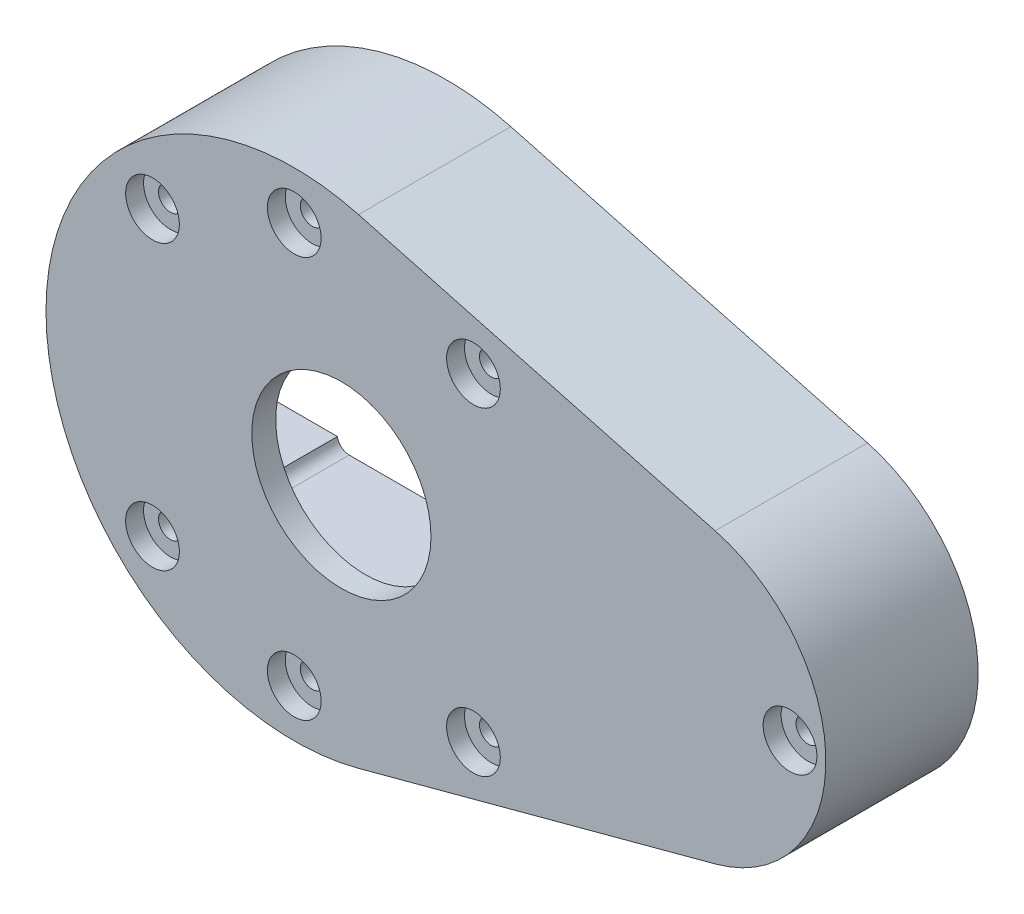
ISO-10303-21;
HEADER;
FILE_DESCRIPTION(('STEP AP214'),'2;1');
FILE_NAME('part.step','',(''),(''),'','','');
FILE_SCHEMA(('AUTOMOTIVE_DESIGN { 1 0 10303 214 1 1 1 1 }'));
ENDSEC;
DATA;
#1=APPLICATION_CONTEXT('core data for automotive mechanical design processes');
#2=APPLICATION_PROTOCOL_DEFINITION('international standard','automotive_design',2000,#1);
#3=PRODUCT_CONTEXT('',#1,'mechanical');
#4=PRODUCT('Part','Part','',(#3));
#5=PRODUCT_RELATED_PRODUCT_CATEGORY('part','',(#4));
#6=PRODUCT_DEFINITION_FORMATION('','',#4);
#7=PRODUCT_DEFINITION_CONTEXT('part definition',#1,'design');
#8=PRODUCT_DEFINITION('design','',#6,#7);
#9=PRODUCT_DEFINITION_SHAPE('','',#8);
#10=(LENGTH_UNIT() NAMED_UNIT(*) SI_UNIT(.MILLI.,.METRE.));
#11=(NAMED_UNIT(*) PLANE_ANGLE_UNIT() SI_UNIT($,.RADIAN.));
#12=(NAMED_UNIT(*) SI_UNIT($,.STERADIAN.) SOLID_ANGLE_UNIT());
#13=UNCERTAINTY_MEASURE_WITH_UNIT(LENGTH_MEASURE(1.E-05),#10,'distance_accuracy_value','');
#14=(GEOMETRIC_REPRESENTATION_CONTEXT(3) GLOBAL_UNCERTAINTY_ASSIGNED_CONTEXT((#13)) GLOBAL_UNIT_ASSIGNED_CONTEXT((#10,
#11,#12)) REPRESENTATION_CONTEXT('',''));
#15=CARTESIAN_POINT('',(0.,0.,0.));
#16=DIRECTION('',(0.,0.,1.));
#17=DIRECTION('',(1.,0.,0.));
#18=AXIS2_PLACEMENT_3D('',#15,#16,#17);
#19=CARTESIAN_POINT('',(29.9,0.,12.75));
#20=DIRECTION('',(0.,0.,-1.));
#21=DIRECTION('',(-1.,0.,0.));
#22=AXIS2_PLACEMENT_3D('',#19,#20,#21);
#23=CYLINDRICAL_SURFACE('',#22,1.);
#24=CARTESIAN_POINT('',(29.9,0.,0.));
#25=DIRECTION('',(0.,0.,1.));
#26=DIRECTION('',(1.,0.,0.));
#27=AXIS2_PLACEMENT_3D('',#24,#25,#26);
#28=CIRCLE('',#27,1.);
#29=CARTESIAN_POINT('',(30.9,0.,0.));
#30=VERTEX_POINT('',#29);
#31=EDGE_CURVE('E378',#30,#30,#28,.T.);
#32=ORIENTED_EDGE('',*,*,#31,.F.);
#33=EDGE_LOOP('',(#32));
#34=FACE_BOUND('',#33,.T.);
#35=CARTESIAN_POINT('',(29.9,0.,11.25));
#36=DIRECTION('',(0.,0.,1.));
#37=DIRECTION('',(1.,0.,0.));
#38=AXIS2_PLACEMENT_3D('',#35,#36,#37);
#39=CIRCLE('',#38,1.);
#40=CARTESIAN_POINT('',(30.9,0.,11.25));
#41=VERTEX_POINT('',#40);
#42=EDGE_CURVE('E47',#41,#41,#39,.T.);
#43=ORIENTED_EDGE('',*,*,#42,.T.);
#44=EDGE_LOOP('',(#43));
#45=FACE_BOUND('',#44,.T.);
#46=ADVANCED_FACE('F43',(#34,#45),#23,.F.);
#47=CARTESIAN_POINT('',(3.40000000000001,13.3549838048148,12.75));
#48=DIRECTION('',(0.,0.,-1.));
#49=DIRECTION('',(-1.,0.,0.));
#50=AXIS2_PLACEMENT_3D('',#47,#48,#49);
#51=CYLINDRICAL_SURFACE('',#50,1.);
#52=CARTESIAN_POINT('',(3.40000000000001,13.3549838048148,0.));
#53=DIRECTION('',(0.,0.,1.));
#54=DIRECTION('',(1.,0.,0.));
#55=AXIS2_PLACEMENT_3D('',#52,#53,#54);
#56=CIRCLE('',#55,1.);
#57=CARTESIAN_POINT('',(4.40000000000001,13.3549838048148,0.));
#58=VERTEX_POINT('',#57);
#59=EDGE_CURVE('E375',#58,#58,#56,.T.);
#60=ORIENTED_EDGE('',*,*,#59,.F.);
#61=EDGE_LOOP('',(#60));
#62=FACE_BOUND('',#61,.T.);
#63=CARTESIAN_POINT('',(3.40000000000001,13.3549838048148,11.25));
#64=DIRECTION('',(0.,0.,1.));
#65=DIRECTION('',(1.,0.,0.));
#66=AXIS2_PLACEMENT_3D('',#63,#64,#65);
#67=CIRCLE('',#66,1.);
#68=CARTESIAN_POINT('',(4.40000000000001,13.3549838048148,11.25));
#69=VERTEX_POINT('',#68);
#70=EDGE_CURVE('E261',#69,#69,#67,.T.);
#71=ORIENTED_EDGE('',*,*,#70,.T.);
#72=EDGE_LOOP('',(#71));
#73=FACE_BOUND('',#72,.T.);
#74=ADVANCED_FACE('F418',(#62,#73),#51,.F.);
#75=CARTESIAN_POINT('',(-11.6000000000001,16.7822094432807,12.75));
#76=DIRECTION('',(0.,0.,-1.));
#77=DIRECTION('',(-1.,0.,0.));
#78=AXIS2_PLACEMENT_3D('',#75,#76,#77);
#79=CYLINDRICAL_SURFACE('',#78,1.);
#80=CARTESIAN_POINT('',(-11.6000000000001,16.7822094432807,0.));
#81=DIRECTION('',(0.,0.,1.));
#82=DIRECTION('',(1.,0.,0.));
#83=AXIS2_PLACEMENT_3D('',#80,#81,#82);
#84=CIRCLE('',#83,1.);
#85=CARTESIAN_POINT('',(-10.6000000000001,16.7822094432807,0.));
#86=VERTEX_POINT('',#85);
#87=EDGE_CURVE('E372',#86,#86,#84,.T.);
#88=ORIENTED_EDGE('',*,*,#87,.F.);
#89=EDGE_LOOP('',(#88));
#90=FACE_BOUND('',#89,.T.);
#91=CARTESIAN_POINT('',(-11.6000000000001,16.7822094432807,11.25));
#92=DIRECTION('',(0.,0.,1.));
#93=DIRECTION('',(1.,0.,0.));
#94=AXIS2_PLACEMENT_3D('',#91,#92,#93);
#95=CIRCLE('',#94,1.);
#96=CARTESIAN_POINT('',(-10.6000000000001,16.7822094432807,11.25));
#97=VERTEX_POINT('',#96);
#98=EDGE_CURVE('E259',#97,#97,#95,.T.);
#99=ORIENTED_EDGE('',*,*,#98,.T.);
#100=EDGE_LOOP('',(#99));
#101=FACE_BOUND('',#100,.T.);
#102=ADVANCED_FACE('F423',(#90,#101),#79,.F.);
#103=CARTESIAN_POINT('',(3.40000000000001,-13.3549838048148,12.75));
#104=DIRECTION('',(0.,0.,-1.));
#105=DIRECTION('',(-1.,0.,0.));
#106=AXIS2_PLACEMENT_3D('',#103,#104,#105);
#107=CYLINDRICAL_SURFACE('',#106,1.);
#108=CARTESIAN_POINT('',(3.40000000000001,-13.3549838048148,0.));
#109=DIRECTION('',(0.,0.,1.));
#110=DIRECTION('',(1.,0.,0.));
#111=AXIS2_PLACEMENT_3D('',#108,#109,#110);
#112=CIRCLE('',#111,1.);
#113=CARTESIAN_POINT('',(4.40000000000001,-13.3549838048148,0.));
#114=VERTEX_POINT('',#113);
#115=EDGE_CURVE('E369',#114,#114,#112,.T.);
#116=ORIENTED_EDGE('',*,*,#115,.F.);
#117=EDGE_LOOP('',(#116));
#118=FACE_BOUND('',#117,.T.);
#119=CARTESIAN_POINT('',(3.40000000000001,-13.3549838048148,11.25));
#120=DIRECTION('',(0.,0.,1.));
#121=DIRECTION('',(1.,0.,0.));
#122=AXIS2_PLACEMENT_3D('',#119,#120,#121);
#123=CIRCLE('',#122,1.);
#124=CARTESIAN_POINT('',(4.40000000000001,-13.3549838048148,11.25));
#125=VERTEX_POINT('',#124);
#126=EDGE_CURVE('E256',#125,#125,#123,.T.);
#127=ORIENTED_EDGE('',*,*,#126,.T.);
#128=EDGE_LOOP('',(#127));
#129=FACE_BOUND('',#128,.T.);
#130=ADVANCED_FACE('F430',(#118,#129),#107,.F.);
#131=CARTESIAN_POINT('',(-11.6,-16.7822094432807,12.75));
#132=DIRECTION('',(0.,0.,-1.));
#133=DIRECTION('',(-1.,0.,0.));
#134=AXIS2_PLACEMENT_3D('',#131,#132,#133);
#135=CYLINDRICAL_SURFACE('',#134,1.);
#136=CARTESIAN_POINT('',(-11.6,-16.7822094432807,0.));
#137=DIRECTION('',(0.,0.,1.));
#138=DIRECTION('',(1.,0.,0.));
#139=AXIS2_PLACEMENT_3D('',#136,#137,#138);
#140=CIRCLE('',#139,1.);
#141=CARTESIAN_POINT('',(-10.6,-16.7822094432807,0.));
#142=VERTEX_POINT('',#141);
#143=EDGE_CURVE('E366',#142,#142,#140,.T.);
#144=ORIENTED_EDGE('',*,*,#143,.F.);
#145=EDGE_LOOP('',(#144));
#146=FACE_BOUND('',#145,.T.);
#147=CARTESIAN_POINT('',(-11.6,-16.7822094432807,11.25));
#148=DIRECTION('',(0.,0.,1.));
#149=DIRECTION('',(1.,0.,0.));
#150=AXIS2_PLACEMENT_3D('',#147,#148,#149);
#151=CIRCLE('',#150,1.);
#152=CARTESIAN_POINT('',(-10.6,-16.7822094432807,11.25));
#153=VERTEX_POINT('',#152);
#154=EDGE_CURVE('E253',#153,#153,#151,.T.);
#155=ORIENTED_EDGE('',*,*,#154,.T.);
#156=EDGE_LOOP('',(#155));
#157=FACE_BOUND('',#156,.T.);
#158=ADVANCED_FACE('F434',(#146,#157),#135,.F.);
#159=CARTESIAN_POINT('',(-23.4668141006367,-11.8668141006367,12.75));
#160=DIRECTION('',(0.,0.,-1.));
#161=DIRECTION('',(-1.,0.,0.));
#162=AXIS2_PLACEMENT_3D('',#159,#160,#161);
#163=CYLINDRICAL_SURFACE('',#162,1.);
#164=CARTESIAN_POINT('',(-23.4668141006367,-11.8668141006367,0.));
#165=DIRECTION('',(0.,0.,1.));
#166=DIRECTION('',(1.,0.,0.));
#167=AXIS2_PLACEMENT_3D('',#164,#165,#166);
#168=CIRCLE('',#167,1.);
#169=CARTESIAN_POINT('',(-22.4668141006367,-11.8668141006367,0.));
#170=VERTEX_POINT('',#169);
#171=EDGE_CURVE('E363',#170,#170,#168,.T.);
#172=ORIENTED_EDGE('',*,*,#171,.F.);
#173=EDGE_LOOP('',(#172));
#174=FACE_BOUND('',#173,.T.);
#175=CARTESIAN_POINT('',(-23.4668141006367,-11.8668141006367,11.25));
#176=DIRECTION('',(0.,0.,1.));
#177=DIRECTION('',(1.,0.,0.));
#178=AXIS2_PLACEMENT_3D('',#175,#176,#177);
#179=CIRCLE('',#178,1.);
#180=CARTESIAN_POINT('',(-22.4668141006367,-11.8668141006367,11.25));
#181=VERTEX_POINT('',#180);
#182=EDGE_CURVE('E249',#181,#181,#179,.T.);
#183=ORIENTED_EDGE('',*,*,#182,.T.);
#184=EDGE_LOOP('',(#183));
#185=FACE_BOUND('',#184,.T.);
#186=ADVANCED_FACE('F438',(#174,#185),#163,.F.);
#187=CARTESIAN_POINT('',(-23.4668141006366,11.8668141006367,12.75));
#188=DIRECTION('',(0.,0.,-1.));
#189=DIRECTION('',(-1.,0.,0.));
#190=AXIS2_PLACEMENT_3D('',#187,#188,#189);
#191=CYLINDRICAL_SURFACE('',#190,0.999999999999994);
#192=CARTESIAN_POINT('',(-23.4668141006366,11.8668141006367,0.));
#193=DIRECTION('',(0.,0.,1.));
#194=DIRECTION('',(1.,0.,0.));
#195=AXIS2_PLACEMENT_3D('',#192,#193,#194);
#196=CIRCLE('',#195,0.999999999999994);
#197=CARTESIAN_POINT('',(-22.4668141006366,11.8668141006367,0.));
#198=VERTEX_POINT('',#197);
#199=EDGE_CURVE('E360',#198,#198,#196,.T.);
#200=ORIENTED_EDGE('',*,*,#199,.F.);
#201=EDGE_LOOP('',(#200));
#202=FACE_BOUND('',#201,.T.);
#203=CARTESIAN_POINT('',(-23.4668141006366,11.8668141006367,11.25));
#204=DIRECTION('',(0.,0.,1.));
#205=DIRECTION('',(1.,0.,0.));
#206=AXIS2_PLACEMENT_3D('',#203,#204,#205);
#207=CIRCLE('',#206,0.999999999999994);
#208=CARTESIAN_POINT('',(-22.4668141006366,11.8668141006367,11.25));
#209=VERTEX_POINT('',#208);
#210=EDGE_CURVE('E246',#209,#209,#207,.T.);
#211=ORIENTED_EDGE('',*,*,#210,.T.);
#212=EDGE_LOOP('',(#211));
#213=FACE_BOUND('',#212,.T.);
#214=ADVANCED_FACE('F442',(#202,#213),#191,.F.);
#215=CARTESIAN_POINT('',(19.75,9.49999999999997,12.75));
#216=DIRECTION('',(0.,0.,-1.));
#217=DIRECTION('',(-1.,0.,0.));
#218=AXIS2_PLACEMENT_3D('',#215,#216,#217);
#219=CYLINDRICAL_SURFACE('',#218,1.);
#220=DIRECTION('',(0.,0.,-1.));
#221=VECTOR('',#220,1.);
#222=CARTESIAN_POINT('',(20.7386859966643,9.64999999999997,12.75));
#223=LINE('',#222,#221);
#224=CARTESIAN_POINT('',(20.7386859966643,9.64999999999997,10.75));
#225=VERTEX_POINT('',#224);
#226=CARTESIAN_POINT('',(20.7386859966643,9.64999999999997,0.));
#227=VERTEX_POINT('',#226);
#228=EDGE_CURVE('E201',#225,#227,#223,.T.);
#229=ORIENTED_EDGE('',*,*,#228,.F.);
#230=CARTESIAN_POINT('',(19.75,9.49999999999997,10.75));
#231=DIRECTION('',(0.,0.,1.));
#232=DIRECTION('',(1.,0.,0.));
#233=AXIS2_PLACEMENT_3D('',#230,#231,#232);
#234=CIRCLE('',#233,1.);
#235=CARTESIAN_POINT('',(19.75,10.5,10.75));
#236=VERTEX_POINT('',#235);
#237=EDGE_CURVE('E189',#225,#236,#234,.T.);
#238=ORIENTED_EDGE('',*,*,#237,.T.);
#239=DIRECTION('',(0.,0.,-1.));
#240=VECTOR('',#239,1.);
#241=CARTESIAN_POINT('',(19.75,10.5,12.75));
#242=LINE('',#241,#240);
#243=CARTESIAN_POINT('',(19.75,10.5,0.));
#244=VERTEX_POINT('',#243);
#245=EDGE_CURVE('E199',#236,#244,#242,.T.);
#246=ORIENTED_EDGE('',*,*,#245,.T.);
#247=CARTESIAN_POINT('',(19.75,9.49999999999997,0.));
#248=DIRECTION('',(0.,0.,1.));
#249=DIRECTION('',(1.,0.,0.));
#250=AXIS2_PLACEMENT_3D('',#247,#248,#249);
#251=CIRCLE('',#250,1.);
#252=EDGE_CURVE('E202',#227,#244,#251,.T.);
#253=ORIENTED_EDGE('',*,*,#252,.F.);
#254=EDGE_LOOP('',(#229,#238,#246,#253));
#255=FACE_BOUND('',#254,.T.);
#256=ADVANCED_FACE('F45',(#255),#219,.F.);
#257=CARTESIAN_POINT('',(0.,9.64999999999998,12.75));
#258=DIRECTION('',(0.,1.,0.));
#259=DIRECTION('',(-1.,0.,0.));
#260=AXIS2_PLACEMENT_3D('',#257,#258,#259);
#261=PLANE('',#260);
#262=DIRECTION('',(1.,0.,0.));
#263=VECTOR('',#262,1.);
#264=CARTESIAN_POINT('',(0.,9.64999999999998,10.75));
#265=LINE('',#264,#263);
#266=CARTESIAN_POINT('',(25.75,9.64999999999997,10.75));
#267=VERTEX_POINT('',#266);
#268=EDGE_CURVE('E203',#225,#267,#265,.T.);
#269=ORIENTED_EDGE('',*,*,#268,.F.);
#270=ORIENTED_EDGE('',*,*,#228,.T.);
#271=DIRECTION('',(1.,0.,0.));
#272=VECTOR('',#271,1.);
#273=CARTESIAN_POINT('',(0.,9.64999999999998,0.));
#274=LINE('',#273,#272);
#275=CARTESIAN_POINT('',(25.75,9.64999999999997,0.));
#276=VERTEX_POINT('',#275);
#277=EDGE_CURVE('E317',#227,#276,#274,.T.);
#278=ORIENTED_EDGE('',*,*,#277,.T.);
#279=DIRECTION('',(0.,0.,-1.));
#280=VECTOR('',#279,1.);
#281=CARTESIAN_POINT('',(25.75,9.64999999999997,12.75));
#282=LINE('',#281,#280);
#283=EDGE_CURVE('E240',#267,#276,#282,.T.);
#284=ORIENTED_EDGE('',*,*,#283,.F.);
#285=EDGE_LOOP('',(#269,#270,#278,#284));
#286=FACE_BOUND('',#285,.T.);
#287=ADVANCED_FACE('F496',(#286),#261,.F.);
#288=CARTESIAN_POINT('',(25.75,7.64999999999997,12.75));
#289=DIRECTION('',(0.,0.,-1.));
#290=DIRECTION('',(-1.,0.,0.));
#291=AXIS2_PLACEMENT_3D('',#288,#289,#290);
#292=CYLINDRICAL_SURFACE('',#291,2.);
#293=DIRECTION('',(0.,0.,-1.));
#294=VECTOR('',#293,1.);
#295=CARTESIAN_POINT('',(27.75,7.64999999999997,12.75));
#296=LINE('',#295,#294);
#297=CARTESIAN_POINT('',(27.75,7.64999999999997,10.75));
#298=VERTEX_POINT('',#297);
#299=CARTESIAN_POINT('',(27.75,7.64999999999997,0.));
#300=VERTEX_POINT('',#299);
#301=EDGE_CURVE('E238',#298,#300,#296,.T.);
#302=ORIENTED_EDGE('',*,*,#301,.F.);
#303=CARTESIAN_POINT('',(25.75,7.64999999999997,10.75));
#304=DIRECTION('',(0.,0.,1.));
#305=DIRECTION('',(1.,0.,0.));
#306=AXIS2_PLACEMENT_3D('',#303,#304,#305);
#307=CIRCLE('',#306,2.);
#308=EDGE_CURVE('E305',#298,#267,#307,.T.);
#309=ORIENTED_EDGE('',*,*,#308,.T.);
#310=ORIENTED_EDGE('',*,*,#283,.T.);
#311=CARTESIAN_POINT('',(25.75,7.64999999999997,0.));
#312=DIRECTION('',(0.,0.,1.));
#313=DIRECTION('',(1.,0.,0.));
#314=AXIS2_PLACEMENT_3D('',#311,#312,#313);
#315=CIRCLE('',#314,2.);
#316=EDGE_CURVE('E320',#300,#276,#315,.T.);
#317=ORIENTED_EDGE('',*,*,#316,.F.);
#318=EDGE_LOOP('',(#302,#309,#310,#317));
#319=FACE_BOUND('',#318,.T.);
#320=ADVANCED_FACE('F493',(#319),#292,.F.);
#321=CARTESIAN_POINT('',(27.75,0.,12.75));
#322=DIRECTION('',(1.,0.,0.));
#323=DIRECTION('',(0.,1.,0.));
#324=AXIS2_PLACEMENT_3D('',#321,#322,#323);
#325=PLANE('',#324);
#326=DIRECTION('',(0.,-1.,0.));
#327=VECTOR('',#326,1.);
#328=CARTESIAN_POINT('',(27.75,0.,10.75));
#329=LINE('',#328,#327);
#330=CARTESIAN_POINT('',(27.75,-7.65000000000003,10.75));
#331=VERTEX_POINT('',#330);
#332=EDGE_CURVE('E303',#298,#331,#329,.T.);
#333=ORIENTED_EDGE('',*,*,#332,.F.);
#334=ORIENTED_EDGE('',*,*,#301,.T.);
#335=DIRECTION('',(0.,-1.,0.));
#336=VECTOR('',#335,1.);
#337=CARTESIAN_POINT('',(27.75,0.,0.));
#338=LINE('',#337,#336);
#339=CARTESIAN_POINT('',(27.75,-7.65000000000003,0.));
#340=VERTEX_POINT('',#339);
#341=EDGE_CURVE('E323',#300,#340,#338,.T.);
#342=ORIENTED_EDGE('',*,*,#341,.T.);
#343=DIRECTION('',(0.,0.,-1.));
#344=VECTOR('',#343,1.);
#345=CARTESIAN_POINT('',(27.75,-7.65000000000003,12.75));
#346=LINE('',#345,#344);
#347=EDGE_CURVE('E236',#331,#340,#346,.T.);
#348=ORIENTED_EDGE('',*,*,#347,.F.);
#349=EDGE_LOOP('',(#333,#334,#342,#348));
#350=FACE_BOUND('',#349,.T.);
#351=ADVANCED_FACE('F489',(#350),#325,.F.);
#352=CARTESIAN_POINT('',(25.75,-7.65000000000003,12.75));
#353=DIRECTION('',(0.,0.,-1.));
#354=DIRECTION('',(-1.,0.,0.));
#355=AXIS2_PLACEMENT_3D('',#352,#353,#354);
#356=CYLINDRICAL_SURFACE('',#355,2.);
#357=DIRECTION('',(0.,0.,-1.));
#358=VECTOR('',#357,1.);
#359=CARTESIAN_POINT('',(25.75,-9.65000000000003,12.75));
#360=LINE('',#359,#358);
#361=CARTESIAN_POINT('',(25.75,-9.65000000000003,10.75));
#362=VERTEX_POINT('',#361);
#363=CARTESIAN_POINT('',(25.75,-9.65000000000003,0.));
#364=VERTEX_POINT('',#363);
#365=EDGE_CURVE('E234',#362,#364,#360,.T.);
#366=ORIENTED_EDGE('',*,*,#365,.F.);
#367=CARTESIAN_POINT('',(25.75,-7.65000000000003,10.75));
#368=DIRECTION('',(0.,0.,1.));
#369=DIRECTION('',(1.,0.,0.));
#370=AXIS2_PLACEMENT_3D('',#367,#368,#369);
#371=CIRCLE('',#370,2.);
#372=EDGE_CURVE('E300',#362,#331,#371,.T.);
#373=ORIENTED_EDGE('',*,*,#372,.T.);
#374=ORIENTED_EDGE('',*,*,#347,.T.);
#375=CARTESIAN_POINT('',(25.75,-7.65000000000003,0.));
#376=DIRECTION('',(0.,0.,1.));
#377=DIRECTION('',(1.,0.,0.));
#378=AXIS2_PLACEMENT_3D('',#375,#376,#377);
#379=CIRCLE('',#378,2.);
#380=EDGE_CURVE('E326',#364,#340,#379,.T.);
#381=ORIENTED_EDGE('',*,*,#380,.F.);
#382=EDGE_LOOP('',(#366,#373,#374,#381));
#383=FACE_BOUND('',#382,.T.);
#384=ADVANCED_FACE('F485',(#383),#356,.F.);
#385=CARTESIAN_POINT('',(0.,-9.65000000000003,12.75));
#386=DIRECTION('',(0.,-1.,0.));
#387=DIRECTION('',(0.,0.,-1.));
#388=AXIS2_PLACEMENT_3D('',#385,#386,#387);
#389=PLANE('',#388);
#390=DIRECTION('',(-1.,0.,0.));
#391=VECTOR('',#390,1.);
#392=CARTESIAN_POINT('',(0.,-9.65000000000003,10.75));
#393=LINE('',#392,#391);
#394=CARTESIAN_POINT('',(20.7386859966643,-9.65000000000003,10.75));
#395=VERTEX_POINT('',#394);
#396=EDGE_CURVE('E298',#362,#395,#393,.T.);
#397=ORIENTED_EDGE('',*,*,#396,.F.);
#398=ORIENTED_EDGE('',*,*,#365,.T.);
#399=DIRECTION('',(-1.,0.,0.));
#400=VECTOR('',#399,1.);
#401=CARTESIAN_POINT('',(0.,-9.65000000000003,0.));
#402=LINE('',#401,#400);
#403=CARTESIAN_POINT('',(20.7386859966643,-9.65000000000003,0.));
#404=VERTEX_POINT('',#403);
#405=EDGE_CURVE('E329',#364,#404,#402,.T.);
#406=ORIENTED_EDGE('',*,*,#405,.T.);
#407=DIRECTION('',(0.,0.,-1.));
#408=VECTOR('',#407,1.);
#409=CARTESIAN_POINT('',(20.7386859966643,-9.65000000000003,12.75));
#410=LINE('',#409,#408);
#411=EDGE_CURVE('E232',#395,#404,#410,.T.);
#412=ORIENTED_EDGE('',*,*,#411,.F.);
#413=EDGE_LOOP('',(#397,#398,#406,#412));
#414=FACE_BOUND('',#413,.T.);
#415=ADVANCED_FACE('F481',(#414),#389,.F.);
#416=CARTESIAN_POINT('',(19.75,-9.50000000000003,12.75));
#417=DIRECTION('',(0.,0.,-1.));
#418=DIRECTION('',(-1.,0.,0.));
#419=AXIS2_PLACEMENT_3D('',#416,#417,#418);
#420=CYLINDRICAL_SURFACE('',#419,1.);
#421=DIRECTION('',(0.,0.,-1.));
#422=VECTOR('',#421,1.);
#423=CARTESIAN_POINT('',(19.75,-10.5,12.75));
#424=LINE('',#423,#422);
#425=CARTESIAN_POINT('',(19.75,-10.5,10.75));
#426=VERTEX_POINT('',#425);
#427=CARTESIAN_POINT('',(19.75,-10.5,0.));
#428=VERTEX_POINT('',#427);
#429=EDGE_CURVE('E230',#426,#428,#424,.T.);
#430=ORIENTED_EDGE('',*,*,#429,.F.);
#431=CARTESIAN_POINT('',(19.75,-9.50000000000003,10.75));
#432=DIRECTION('',(0.,0.,1.));
#433=DIRECTION('',(1.,0.,0.));
#434=AXIS2_PLACEMENT_3D('',#431,#432,#433);
#435=CIRCLE('',#434,1.);
#436=EDGE_CURVE('E295',#426,#395,#435,.T.);
#437=ORIENTED_EDGE('',*,*,#436,.T.);
#438=ORIENTED_EDGE('',*,*,#411,.T.);
#439=CARTESIAN_POINT('',(19.75,-9.50000000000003,0.));
#440=DIRECTION('',(0.,0.,1.));
#441=DIRECTION('',(1.,0.,0.));
#442=AXIS2_PLACEMENT_3D('',#439,#440,#441);
#443=CIRCLE('',#442,1.);
#444=EDGE_CURVE('E332',#428,#404,#443,.T.);
#445=ORIENTED_EDGE('',*,*,#444,.F.);
#446=EDGE_LOOP('',(#430,#437,#438,#445));
#447=FACE_BOUND('',#446,.T.);
#448=ADVANCED_FACE('F477',(#447),#420,.F.);
#449=CARTESIAN_POINT('',(0.,-10.5,12.75));
#450=DIRECTION('',(0.,1.,0.));
#451=DIRECTION('',(0.,0.,1.));
#452=AXIS2_PLACEMENT_3D('',#449,#450,#451);
#453=PLANE('',#452);
#454=DIRECTION('',(0.,0.,-1.));
#455=VECTOR('',#454,1.);
#456=CARTESIAN_POINT('',(-19.75,-10.5,12.75));
#457=LINE('',#456,#455);
#458=CARTESIAN_POINT('',(-19.75,-10.5,10.75));
#459=VERTEX_POINT('',#458);
#460=CARTESIAN_POINT('',(-19.75,-10.5,0.));
#461=VERTEX_POINT('',#460);
#462=EDGE_CURVE('E228',#459,#461,#457,.T.);
#463=ORIENTED_EDGE('',*,*,#462,.F.);
#464=DIRECTION('',(1.,0.,0.));
#465=VECTOR('',#464,1.);
#466=CARTESIAN_POINT('',(0.,-10.5,10.75));
#467=LINE('',#466,#465);
#468=EDGE_CURVE('E292',#459,#426,#467,.T.);
#469=ORIENTED_EDGE('',*,*,#468,.T.);
#470=ORIENTED_EDGE('',*,*,#429,.T.);
#471=DIRECTION('',(1.,0.,0.));
#472=VECTOR('',#471,1.);
#473=CARTESIAN_POINT('',(0.,-10.5,0.));
#474=LINE('',#473,#472);
#475=EDGE_CURVE('E335',#461,#428,#474,.T.);
#476=ORIENTED_EDGE('',*,*,#475,.F.);
#477=EDGE_LOOP('',(#463,#469,#470,#476));
#478=FACE_BOUND('',#477,.T.);
#479=ADVANCED_FACE('F473',(#478),#453,.T.);
#480=CARTESIAN_POINT('',(-19.75,-9.50000000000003,12.75));
#481=DIRECTION('',(0.,0.,-1.));
#482=DIRECTION('',(-1.,0.,0.));
#483=AXIS2_PLACEMENT_3D('',#480,#481,#482);
#484=CYLINDRICAL_SURFACE('',#483,1.);
#485=DIRECTION('',(0.,0.,-1.));
#486=VECTOR('',#485,1.);
#487=CARTESIAN_POINT('',(-20.7386859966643,-9.65000000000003,12.75));
#488=LINE('',#487,#486);
#489=CARTESIAN_POINT('',(-20.7386859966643,-9.65000000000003,10.75));
#490=VERTEX_POINT('',#489);
#491=CARTESIAN_POINT('',(-20.7386859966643,-9.65000000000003,0.));
#492=VERTEX_POINT('',#491);
#493=EDGE_CURVE('E226',#490,#492,#488,.T.);
#494=ORIENTED_EDGE('',*,*,#493,.F.);
#495=CARTESIAN_POINT('',(-19.75,-9.50000000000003,10.75));
#496=DIRECTION('',(0.,0.,1.));
#497=DIRECTION('',(1.,0.,0.));
#498=AXIS2_PLACEMENT_3D('',#495,#496,#497);
#499=CIRCLE('',#498,1.);
#500=EDGE_CURVE('E289',#490,#459,#499,.T.);
#501=ORIENTED_EDGE('',*,*,#500,.T.);
#502=ORIENTED_EDGE('',*,*,#462,.T.);
#503=CARTESIAN_POINT('',(-19.75,-9.50000000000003,0.));
#504=DIRECTION('',(0.,0.,1.));
#505=DIRECTION('',(1.,0.,0.));
#506=AXIS2_PLACEMENT_3D('',#503,#504,#505);
#507=CIRCLE('',#506,1.);
#508=EDGE_CURVE('E338',#492,#461,#507,.T.);
#509=ORIENTED_EDGE('',*,*,#508,.F.);
#510=EDGE_LOOP('',(#494,#501,#502,#509));
#511=FACE_BOUND('',#510,.T.);
#512=ADVANCED_FACE('F469',(#511),#484,.F.);
#513=CARTESIAN_POINT('',(0.,-9.65000000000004,12.75));
#514=DIRECTION('',(0.,-1.,0.));
#515=DIRECTION('',(1.,0.,0.));
#516=AXIS2_PLACEMENT_3D('',#513,#514,#515);
#517=PLANE('',#516);
#518=DIRECTION('',(-1.,0.,0.));
#519=VECTOR('',#518,1.);
#520=CARTESIAN_POINT('',(0.,-9.65000000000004,10.75));
#521=LINE('',#520,#519);
#522=CARTESIAN_POINT('',(-25.75,-9.65000000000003,10.75));
#523=VERTEX_POINT('',#522);
#524=EDGE_CURVE('E287',#490,#523,#521,.T.);
#525=ORIENTED_EDGE('',*,*,#524,.F.);
#526=ORIENTED_EDGE('',*,*,#493,.T.);
#527=DIRECTION('',(-1.,0.,0.));
#528=VECTOR('',#527,1.);
#529=CARTESIAN_POINT('',(0.,-9.65000000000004,0.));
#530=LINE('',#529,#528);
#531=CARTESIAN_POINT('',(-25.75,-9.65000000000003,0.));
#532=VERTEX_POINT('',#531);
#533=EDGE_CURVE('E341',#492,#532,#530,.T.);
#534=ORIENTED_EDGE('',*,*,#533,.T.);
#535=DIRECTION('',(0.,0.,-1.));
#536=VECTOR('',#535,1.);
#537=CARTESIAN_POINT('',(-25.75,-9.65000000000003,12.75));
#538=LINE('',#537,#536);
#539=EDGE_CURVE('E224',#523,#532,#538,.T.);
#540=ORIENTED_EDGE('',*,*,#539,.F.);
#541=EDGE_LOOP('',(#525,#526,#534,#540));
#542=FACE_BOUND('',#541,.T.);
#543=ADVANCED_FACE('F465',(#542),#517,.F.);
#544=CARTESIAN_POINT('',(-25.75,-7.65000000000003,12.75));
#545=DIRECTION('',(0.,0.,-1.));
#546=DIRECTION('',(-1.,0.,0.));
#547=AXIS2_PLACEMENT_3D('',#544,#545,#546);
#548=CYLINDRICAL_SURFACE('',#547,2.);
#549=DIRECTION('',(0.,0.,-1.));
#550=VECTOR('',#549,1.);
#551=CARTESIAN_POINT('',(-27.75,-7.65000000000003,12.75));
#552=LINE('',#551,#550);
#553=CARTESIAN_POINT('',(-27.75,-7.65000000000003,10.75));
#554=VERTEX_POINT('',#553);
#555=CARTESIAN_POINT('',(-27.75,-7.65000000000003,0.));
#556=VERTEX_POINT('',#555);
#557=EDGE_CURVE('E222',#554,#556,#552,.T.);
#558=ORIENTED_EDGE('',*,*,#557,.F.);
#559=CARTESIAN_POINT('',(-25.75,-7.65000000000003,10.75));
#560=DIRECTION('',(0.,0.,1.));
#561=DIRECTION('',(1.,0.,0.));
#562=AXIS2_PLACEMENT_3D('',#559,#560,#561);
#563=CIRCLE('',#562,2.);
#564=EDGE_CURVE('E284',#554,#523,#563,.T.);
#565=ORIENTED_EDGE('',*,*,#564,.T.);
#566=ORIENTED_EDGE('',*,*,#539,.T.);
#567=CARTESIAN_POINT('',(-25.75,-7.65000000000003,0.));
#568=DIRECTION('',(0.,0.,1.));
#569=DIRECTION('',(1.,0.,0.));
#570=AXIS2_PLACEMENT_3D('',#567,#568,#569);
#571=CIRCLE('',#570,2.);
#572=EDGE_CURVE('E344',#556,#532,#571,.T.);
#573=ORIENTED_EDGE('',*,*,#572,.F.);
#574=EDGE_LOOP('',(#558,#565,#566,#573));
#575=FACE_BOUND('',#574,.T.);
#576=ADVANCED_FACE('F461',(#575),#548,.F.);
#577=CARTESIAN_POINT('',(-27.75,0.,12.75));
#578=DIRECTION('',(-1.,0.,0.));
#579=DIRECTION('',(0.,0.,1.));
#580=AXIS2_PLACEMENT_3D('',#577,#578,#579);
#581=PLANE('',#580);
#582=DIRECTION('',(0.,1.,0.));
#583=VECTOR('',#582,1.);
#584=CARTESIAN_POINT('',(-27.75,0.,10.75));
#585=LINE('',#584,#583);
#586=CARTESIAN_POINT('',(-27.75,7.64999999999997,10.75));
#587=VERTEX_POINT('',#586);
#588=EDGE_CURVE('E282',#554,#587,#585,.T.);
#589=ORIENTED_EDGE('',*,*,#588,.F.);
#590=ORIENTED_EDGE('',*,*,#557,.T.);
#591=DIRECTION('',(0.,1.,0.));
#592=VECTOR('',#591,1.);
#593=CARTESIAN_POINT('',(-27.75,0.,0.));
#594=LINE('',#593,#592);
#595=CARTESIAN_POINT('',(-27.75,7.64999999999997,0.));
#596=VERTEX_POINT('',#595);
#597=EDGE_CURVE('E347',#556,#596,#594,.T.);
#598=ORIENTED_EDGE('',*,*,#597,.T.);
#599=DIRECTION('',(0.,0.,-1.));
#600=VECTOR('',#599,1.);
#601=CARTESIAN_POINT('',(-27.75,7.64999999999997,12.75));
#602=LINE('',#601,#600);
#603=EDGE_CURVE('E220',#587,#596,#602,.T.);
#604=ORIENTED_EDGE('',*,*,#603,.F.);
#605=EDGE_LOOP('',(#589,#590,#598,#604));
#606=FACE_BOUND('',#605,.T.);
#607=ADVANCED_FACE('F457',(#606),#581,.F.);
#608=CARTESIAN_POINT('',(-25.75,7.64999999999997,12.75));
#609=DIRECTION('',(0.,0.,-1.));
#610=DIRECTION('',(-1.,0.,0.));
#611=AXIS2_PLACEMENT_3D('',#608,#609,#610);
#612=CYLINDRICAL_SURFACE('',#611,2.);
#613=DIRECTION('',(0.,0.,-1.));
#614=VECTOR('',#613,1.);
#615=CARTESIAN_POINT('',(-25.75,9.64999999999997,12.75));
#616=LINE('',#615,#614);
#617=CARTESIAN_POINT('',(-25.75,9.64999999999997,10.75));
#618=VERTEX_POINT('',#617);
#619=CARTESIAN_POINT('',(-25.75,9.64999999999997,0.));
#620=VERTEX_POINT('',#619);
#621=EDGE_CURVE('E218',#618,#620,#616,.T.);
#622=ORIENTED_EDGE('',*,*,#621,.F.);
#623=CARTESIAN_POINT('',(-25.75,7.64999999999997,10.75));
#624=DIRECTION('',(0.,0.,1.));
#625=DIRECTION('',(1.,0.,0.));
#626=AXIS2_PLACEMENT_3D('',#623,#624,#625);
#627=CIRCLE('',#626,2.);
#628=EDGE_CURVE('E279',#618,#587,#627,.T.);
#629=ORIENTED_EDGE('',*,*,#628,.T.);
#630=ORIENTED_EDGE('',*,*,#603,.T.);
#631=CARTESIAN_POINT('',(-25.75,7.64999999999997,0.));
#632=DIRECTION('',(0.,0.,1.));
#633=DIRECTION('',(1.,0.,0.));
#634=AXIS2_PLACEMENT_3D('',#631,#632,#633);
#635=CIRCLE('',#634,2.);
#636=EDGE_CURVE('E350',#620,#596,#635,.T.);
#637=ORIENTED_EDGE('',*,*,#636,.F.);
#638=EDGE_LOOP('',(#622,#629,#630,#637));
#639=FACE_BOUND('',#638,.T.);
#640=ADVANCED_FACE('F453',(#639),#612,.F.);
#641=CARTESIAN_POINT('',(0.,9.64999999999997,12.75));
#642=DIRECTION('',(0.,1.,0.));
#643=DIRECTION('',(0.,0.,1.));
#644=AXIS2_PLACEMENT_3D('',#641,#642,#643);
#645=PLANE('',#644);
#646=DIRECTION('',(1.,0.,0.));
#647=VECTOR('',#646,1.);
#648=CARTESIAN_POINT('',(0.,9.64999999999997,10.75));
#649=LINE('',#648,#647);
#650=CARTESIAN_POINT('',(-20.7386859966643,9.64999999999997,10.75));
#651=VERTEX_POINT('',#650);
#652=EDGE_CURVE('E277',#618,#651,#649,.T.);
#653=ORIENTED_EDGE('',*,*,#652,.F.);
#654=ORIENTED_EDGE('',*,*,#621,.T.);
#655=DIRECTION('',(1.,0.,0.));
#656=VECTOR('',#655,1.);
#657=CARTESIAN_POINT('',(0.,9.64999999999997,0.));
#658=LINE('',#657,#656);
#659=CARTESIAN_POINT('',(-20.7386859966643,9.64999999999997,0.));
#660=VERTEX_POINT('',#659);
#661=EDGE_CURVE('E353',#620,#660,#658,.T.);
#662=ORIENTED_EDGE('',*,*,#661,.T.);
#663=DIRECTION('',(0.,0.,-1.));
#664=VECTOR('',#663,1.);
#665=CARTESIAN_POINT('',(-20.7386859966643,9.64999999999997,12.75));
#666=LINE('',#665,#664);
#667=EDGE_CURVE('E211',#651,#660,#666,.T.);
#668=ORIENTED_EDGE('',*,*,#667,.F.);
#669=EDGE_LOOP('',(#653,#654,#662,#668));
#670=FACE_BOUND('',#669,.T.);
#671=ADVANCED_FACE('F449',(#670),#645,.F.);
#672=CARTESIAN_POINT('',(-19.75,9.49999999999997,12.75));
#673=DIRECTION('',(0.,0.,-1.));
#674=DIRECTION('',(-1.,0.,0.));
#675=AXIS2_PLACEMENT_3D('',#672,#673,#674);
#676=CYLINDRICAL_SURFACE('',#675,1.);
#677=DIRECTION('',(0.,0.,-1.));
#678=VECTOR('',#677,1.);
#679=CARTESIAN_POINT('',(-19.75,10.5,12.75));
#680=LINE('',#679,#678);
#681=CARTESIAN_POINT('',(-19.75,10.5,10.75));
#682=VERTEX_POINT('',#681);
#683=CARTESIAN_POINT('',(-19.75,10.5,0.));
#684=VERTEX_POINT('',#683);
#685=EDGE_CURVE('E209',#682,#684,#680,.T.);
#686=ORIENTED_EDGE('',*,*,#685,.F.);
#687=CARTESIAN_POINT('',(-19.75,9.49999999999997,10.75));
#688=DIRECTION('',(0.,0.,1.));
#689=DIRECTION('',(1.,0.,0.));
#690=AXIS2_PLACEMENT_3D('',#687,#688,#689);
#691=CIRCLE('',#690,1.);
#692=EDGE_CURVE('E60',#682,#651,#691,.T.);
#693=ORIENTED_EDGE('',*,*,#692,.T.);
#694=ORIENTED_EDGE('',*,*,#667,.T.);
#695=CARTESIAN_POINT('',(-19.75,9.49999999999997,0.));
#696=DIRECTION('',(0.,0.,1.));
#697=DIRECTION('',(1.,0.,0.));
#698=AXIS2_PLACEMENT_3D('',#695,#696,#697);
#699=CIRCLE('',#698,1.);
#700=EDGE_CURVE('E356',#684,#660,#699,.T.);
#701=ORIENTED_EDGE('',*,*,#700,.F.);
#702=EDGE_LOOP('',(#686,#693,#694,#701));
#703=FACE_BOUND('',#702,.T.);
#704=ADVANCED_FACE('F414',(#703),#676,.F.);
#705=CARTESIAN_POINT('',(0.,10.5,12.75));
#706=DIRECTION('',(0.,-1.,0.));
#707=DIRECTION('',(0.,0.,-1.));
#708=AXIS2_PLACEMENT_3D('',#705,#706,#707);
#709=PLANE('',#708);
#710=ORIENTED_EDGE('',*,*,#245,.F.);
#711=DIRECTION('',(-1.,0.,0.));
#712=VECTOR('',#711,1.);
#713=CARTESIAN_POINT('',(0.,10.5,10.75));
#714=LINE('',#713,#712);
#715=EDGE_CURVE('E186',#236,#682,#714,.T.);
#716=ORIENTED_EDGE('',*,*,#715,.T.);
#717=ORIENTED_EDGE('',*,*,#685,.T.);
#718=DIRECTION('',(-1.,0.,0.));
#719=VECTOR('',#718,1.);
#720=CARTESIAN_POINT('',(0.,10.5,0.));
#721=LINE('',#720,#719);
#722=EDGE_CURVE('E208',#244,#684,#721,.T.);
#723=ORIENTED_EDGE('',*,*,#722,.F.);
#724=EDGE_LOOP('',(#710,#716,#717,#723));
#725=FACE_BOUND('',#724,.T.);
#726=ADVANCED_FACE('F206',(#725),#709,.T.);
#727=CARTESIAN_POINT('',(4.60177894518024,17.1740728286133,12.75));
#728=DIRECTION('',(0.258819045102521,0.965925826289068,0.));
#729=DIRECTION('',(-0.965925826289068,0.258819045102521,0.));
#730=AXIS2_PLACEMENT_3D('',#727,#728,#729);
#731=PLANE('',#730);
#732=DIRECTION('',(0.,0.,-1.));
#733=VECTOR('',#732,1.);
#734=CARTESIAN_POINT('',(23.6352380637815,12.0740728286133,12.75));
#735=LINE('',#734,#733);
#736=CARTESIAN_POINT('',(23.6352380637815,12.0740728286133,12.75));
#737=VERTEX_POINT('',#736);
#738=CARTESIAN_POINT('',(23.6352380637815,12.0740728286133,0.));
#739=VERTEX_POINT('',#738);
#740=EDGE_CURVE('E138',#737,#739,#735,.T.);
#741=ORIENTED_EDGE('',*,*,#740,.T.);
#742=DIRECTION('',(0.965925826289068,-0.258819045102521,0.));
#743=VECTOR('',#742,1.);
#744=CARTESIAN_POINT('',(4.60177894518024,17.1740728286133,0.));
#745=LINE('',#744,#743);
#746=CARTESIAN_POINT('',(-6.22116839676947,20.0740728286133,0.));
#747=VERTEX_POINT('',#746);
#748=EDGE_CURVE('E381',#747,#739,#745,.T.);
#749=ORIENTED_EDGE('',*,*,#748,.F.);
#750=DIRECTION('',(0.,0.,-1.));
#751=VECTOR('',#750,1.);
#752=CARTESIAN_POINT('',(-6.22116839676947,20.0740728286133,12.75));
#753=LINE('',#752,#751);
#754=CARTESIAN_POINT('',(-6.22116839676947,20.0740728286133,12.75));
#755=VERTEX_POINT('',#754);
#756=EDGE_CURVE('E11',#755,#747,#753,.T.);
#757=ORIENTED_EDGE('',*,*,#756,.F.);
#758=DIRECTION('',(0.965925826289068,-0.258819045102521,0.));
#759=VECTOR('',#758,1.);
#760=CARTESIAN_POINT('',(4.60177894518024,17.1740728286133,12.75));
#761=LINE('',#760,#759);
#762=EDGE_CURVE('E309',#755,#737,#761,.T.);
#763=ORIENTED_EDGE('',*,*,#762,.T.);
#764=EDGE_LOOP('',(#741,#749,#757,#763));
#765=FACE_BOUND('',#764,.T.);
#766=ADVANCED_FACE('F406',(#765),#731,.T.);
#767=CARTESIAN_POINT('',(-11.6,0.,12.75));
#768=DIRECTION('',(0.,0.,-1.));
#769=DIRECTION('',(-1.,0.,0.));
#770=AXIS2_PLACEMENT_3D('',#767,#768,#769);
#771=CYLINDRICAL_SURFACE('',#770,20.7822094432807);
#772=ORIENTED_EDGE('',*,*,#756,.T.);
#773=CARTESIAN_POINT('',(-11.6,0.,0.));
#774=DIRECTION('',(0.,0.,1.));
#775=DIRECTION('',(1.,0.,0.));
#776=AXIS2_PLACEMENT_3D('',#773,#774,#775);
#777=CIRCLE('',#776,20.7822094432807);
#778=CARTESIAN_POINT('',(-6.22116839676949,-20.0740728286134,0.));
#779=VERTEX_POINT('',#778);
#780=EDGE_CURVE('E384',#747,#779,#777,.T.);
#781=ORIENTED_EDGE('',*,*,#780,.T.);
#782=DIRECTION('',(0.,0.,-1.));
#783=VECTOR('',#782,1.);
#784=CARTESIAN_POINT('',(-6.22116839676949,-20.0740728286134,12.75));
#785=LINE('',#784,#783);
#786=CARTESIAN_POINT('',(-6.22116839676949,-20.0740728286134,12.75));
#787=VERTEX_POINT('',#786);
#788=EDGE_CURVE('E52',#787,#779,#785,.T.);
#789=ORIENTED_EDGE('',*,*,#788,.F.);
#790=CARTESIAN_POINT('',(-11.6,0.,12.75));
#791=DIRECTION('',(0.,0.,1.));
#792=DIRECTION('',(1.,0.,0.));
#793=AXIS2_PLACEMENT_3D('',#790,#791,#792);
#794=CIRCLE('',#793,20.7822094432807);
#795=EDGE_CURVE('E311',#755,#787,#794,.T.);
#796=ORIENTED_EDGE('',*,*,#795,.F.);
#797=EDGE_LOOP('',(#772,#781,#789,#796));
#798=FACE_BOUND('',#797,.T.);
#799=ADVANCED_FACE('F399',(#798),#771,.T.);
#800=CARTESIAN_POINT('',(4.60177894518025,-17.1740728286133,12.75));
#801=DIRECTION('',(0.258819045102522,-0.965925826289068,0.));
#802=DIRECTION('',(0.965925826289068,0.258819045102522,0.));
#803=AXIS2_PLACEMENT_3D('',#800,#801,#802);
#804=PLANE('',#803);
#805=ORIENTED_EDGE('',*,*,#788,.T.);
#806=DIRECTION('',(-0.965925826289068,-0.258819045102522,0.));
#807=VECTOR('',#806,1.);
#808=CARTESIAN_POINT('',(4.60177894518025,-17.1740728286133,0.));
#809=LINE('',#808,#807);
#810=CARTESIAN_POINT('',(23.6352380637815,-12.0740728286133,0.));
#811=VERTEX_POINT('',#810);
#812=EDGE_CURVE('E387',#811,#779,#809,.T.);
#813=ORIENTED_EDGE('',*,*,#812,.F.);
#814=DIRECTION('',(0.,0.,-1.));
#815=VECTOR('',#814,1.);
#816=CARTESIAN_POINT('',(23.6352380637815,-12.0740728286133,12.75));
#817=LINE('',#816,#815);
#818=CARTESIAN_POINT('',(23.6352380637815,-12.0740728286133,12.75));
#819=VERTEX_POINT('',#818);
#820=EDGE_CURVE('E392',#819,#811,#817,.T.);
#821=ORIENTED_EDGE('',*,*,#820,.F.);
#822=DIRECTION('',(-0.965925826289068,-0.258819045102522,0.));
#823=VECTOR('',#822,1.);
#824=CARTESIAN_POINT('',(4.60177894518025,-17.1740728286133,12.75));
#825=LINE('',#824,#823);
#826=EDGE_CURVE('E213',#819,#787,#825,.T.);
#827=ORIENTED_EDGE('',*,*,#826,.T.);
#828=EDGE_LOOP('',(#805,#813,#821,#827));
#829=FACE_BOUND('',#828,.T.);
#830=ADVANCED_FACE('F396',(#829),#804,.T.);
#831=CARTESIAN_POINT('',(20.4,0.,12.75));
#832=DIRECTION('',(0.,0.,-1.));
#833=DIRECTION('',(-1.,0.,0.));
#834=AXIS2_PLACEMENT_3D('',#831,#832,#833);
#835=CYLINDRICAL_SURFACE('',#834,12.5);
#836=ORIENTED_EDGE('',*,*,#820,.T.);
#837=CARTESIAN_POINT('',(20.4,0.,0.));
#838=DIRECTION('',(0.,0.,1.));
#839=DIRECTION('',(1.,0.,0.));
#840=AXIS2_PLACEMENT_3D('',#837,#838,#839);
#841=CIRCLE('',#840,12.5);
#842=EDGE_CURVE('E312',#811,#739,#841,.T.);
#843=ORIENTED_EDGE('',*,*,#842,.T.);
#844=ORIENTED_EDGE('',*,*,#740,.F.);
#845=CARTESIAN_POINT('',(20.4,0.,12.75));
#846=DIRECTION('',(0.,0.,1.));
#847=DIRECTION('',(1.,0.,0.));
#848=AXIS2_PLACEMENT_3D('',#845,#846,#847);
#849=CIRCLE('',#848,12.5);
#850=EDGE_CURVE('E69',#819,#737,#849,.T.);
#851=ORIENTED_EDGE('',*,*,#850,.F.);
#852=EDGE_LOOP('',(#836,#843,#844,#851));
#853=FACE_BOUND('',#852,.T.);
#854=ADVANCED_FACE('F404',(#853),#835,.T.);
#855=CARTESIAN_POINT('',(0.,0.,12.75));
#856=DIRECTION('',(0.,0.,1.));
#857=DIRECTION('',(1.,0.,0.));
#858=AXIS2_PLACEMENT_3D('',#855,#856,#857);
#859=PLANE('',#858);
#860=CARTESIAN_POINT('',(-23.4668141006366,11.8668141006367,12.75));
#861=DIRECTION('',(0.,0.,1.));
#862=DIRECTION('',(1.,0.,0.));
#863=AXIS2_PLACEMENT_3D('',#860,#861,#862);
#864=CIRCLE('',#863,2.25);
#865=CARTESIAN_POINT('',(-21.2168141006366,11.8668141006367,12.75));
#866=VERTEX_POINT('',#865);
#867=EDGE_CURVE('E569',#866,#866,#864,.T.);
#868=ORIENTED_EDGE('',*,*,#867,.F.);
#869=EDGE_LOOP('',(#868));
#870=FACE_BOUND('',#869,.T.);
#871=CARTESIAN_POINT('',(-23.4668141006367,-11.8668141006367,12.75));
#872=DIRECTION('',(0.,0.,1.));
#873=DIRECTION('',(1.,0.,0.));
#874=AXIS2_PLACEMENT_3D('',#871,#872,#873);
#875=CIRCLE('',#874,2.25);
#876=CARTESIAN_POINT('',(-21.2168141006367,-11.8668141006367,12.75));
#877=VERTEX_POINT('',#876);
#878=EDGE_CURVE('E575',#877,#877,#875,.T.);
#879=ORIENTED_EDGE('',*,*,#878,.F.);
#880=EDGE_LOOP('',(#879));
#881=FACE_BOUND('',#880,.T.);
#882=CARTESIAN_POINT('',(-11.6,-16.7822094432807,12.75));
#883=DIRECTION('',(0.,0.,1.));
#884=DIRECTION('',(1.,0.,0.));
#885=AXIS2_PLACEMENT_3D('',#882,#883,#884);
#886=CIRCLE('',#885,2.25);
#887=CARTESIAN_POINT('',(-9.34999999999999,-16.7822094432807,12.75));
#888=VERTEX_POINT('',#887);
#889=EDGE_CURVE('E581',#888,#888,#886,.T.);
#890=ORIENTED_EDGE('',*,*,#889,.F.);
#891=EDGE_LOOP('',(#890));
#892=FACE_BOUND('',#891,.T.);
#893=CARTESIAN_POINT('',(3.40000000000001,-13.3549838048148,12.75));
#894=DIRECTION('',(0.,0.,1.));
#895=DIRECTION('',(1.,0.,0.));
#896=AXIS2_PLACEMENT_3D('',#893,#894,#895);
#897=CIRCLE('',#896,2.25);
#898=CARTESIAN_POINT('',(5.65000000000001,-13.3549838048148,12.75));
#899=VERTEX_POINT('',#898);
#900=EDGE_CURVE('E587',#899,#899,#897,.T.);
#901=ORIENTED_EDGE('',*,*,#900,.F.);
#902=EDGE_LOOP('',(#901));
#903=FACE_BOUND('',#902,.T.);
#904=CARTESIAN_POINT('',(29.9,0.,12.75));
#905=DIRECTION('',(0.,0.,1.));
#906=DIRECTION('',(1.,0.,0.));
#907=AXIS2_PLACEMENT_3D('',#904,#905,#906);
#908=CIRCLE('',#907,2.25);
#909=CARTESIAN_POINT('',(32.15,0.,12.75));
#910=VERTEX_POINT('',#909);
#911=EDGE_CURVE('E593',#910,#910,#908,.T.);
#912=ORIENTED_EDGE('',*,*,#911,.F.);
#913=EDGE_LOOP('',(#912));
#914=FACE_BOUND('',#913,.T.);
#915=CARTESIAN_POINT('',(3.40000000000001,13.3549838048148,12.75));
#916=DIRECTION('',(0.,0.,1.));
#917=DIRECTION('',(1.,0.,0.));
#918=AXIS2_PLACEMENT_3D('',#915,#916,#917);
#919=CIRCLE('',#918,2.25);
#920=CARTESIAN_POINT('',(5.65000000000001,13.3549838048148,12.75));
#921=VERTEX_POINT('',#920);
#922=EDGE_CURVE('E564',#921,#921,#919,.T.);
#923=ORIENTED_EDGE('',*,*,#922,.F.);
#924=EDGE_LOOP('',(#923));
#925=FACE_BOUND('',#924,.T.);
#926=CARTESIAN_POINT('',(-11.6000000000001,16.7822094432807,12.75));
#927=DIRECTION('',(0.,0.,1.));
#928=DIRECTION('',(1.,0.,0.));
#929=AXIS2_PLACEMENT_3D('',#926,#927,#928);
#930=CIRCLE('',#929,2.25);
#931=CARTESIAN_POINT('',(-9.35000000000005,16.7822094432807,12.75));
#932=VERTEX_POINT('',#931);
#933=EDGE_CURVE('E273',#932,#932,#930,.T.);
#934=ORIENTED_EDGE('',*,*,#933,.F.);
#935=EDGE_LOOP('',(#934));
#936=FACE_BOUND('',#935,.T.);
#937=CARTESIAN_POINT('',(-7.6559406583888,-0.250000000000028,12.75));
#938=DIRECTION('',(0.,0.,1.));
#939=DIRECTION('',(1.,0.,0.));
#940=AXIS2_PLACEMENT_3D('',#937,#938,#939);
#941=CIRCLE('',#940,7.50000000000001);
#942=CARTESIAN_POINT('',(-0.155940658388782,-0.250000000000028,12.75));
#943=VERTEX_POINT('',#942);
#944=EDGE_CURVE('E245',#943,#943,#941,.T.);
#945=ORIENTED_EDGE('',*,*,#944,.F.);
#946=EDGE_LOOP('',(#945));
#947=FACE_BOUND('',#946,.T.);
#948=ORIENTED_EDGE('',*,*,#762,.F.);
#949=ORIENTED_EDGE('',*,*,#795,.T.);
#950=ORIENTED_EDGE('',*,*,#826,.F.);
#951=ORIENTED_EDGE('',*,*,#850,.T.);
#952=EDGE_LOOP('',(#948,#949,#950,#951));
#953=FACE_BOUND('',#952,.T.);
#954=ADVANCED_FACE('F405',(#870,#881,#892,#903,#914,#925,#936,#947,#953),#859,.T.);
#955=CARTESIAN_POINT('',(0.,0.,0.));
#956=DIRECTION('',(0.,0.,1.));
#957=DIRECTION('',(1.,0.,0.));
#958=AXIS2_PLACEMENT_3D('',#955,#956,#957);
#959=PLANE('',#958);
#960=ORIENTED_EDGE('',*,*,#252,.T.);
#961=ORIENTED_EDGE('',*,*,#722,.T.);
#962=ORIENTED_EDGE('',*,*,#700,.T.);
#963=ORIENTED_EDGE('',*,*,#661,.F.);
#964=ORIENTED_EDGE('',*,*,#636,.T.);
#965=ORIENTED_EDGE('',*,*,#597,.F.);
#966=ORIENTED_EDGE('',*,*,#572,.T.);
#967=ORIENTED_EDGE('',*,*,#533,.F.);
#968=ORIENTED_EDGE('',*,*,#508,.T.);
#969=ORIENTED_EDGE('',*,*,#475,.T.);
#970=ORIENTED_EDGE('',*,*,#444,.T.);
#971=ORIENTED_EDGE('',*,*,#405,.F.);
#972=ORIENTED_EDGE('',*,*,#380,.T.);
#973=ORIENTED_EDGE('',*,*,#341,.F.);
#974=ORIENTED_EDGE('',*,*,#316,.T.);
#975=ORIENTED_EDGE('',*,*,#277,.F.);
#976=EDGE_LOOP('',(#960,#961,#962,#963,#964,#965,#966,#967,#968,#969,#970,#971,#972,#973,#974,#975));
#977=FACE_BOUND('',#976,.T.);
#978=ORIENTED_EDGE('',*,*,#199,.T.);
#979=EDGE_LOOP('',(#978));
#980=FACE_BOUND('',#979,.T.);
#981=ORIENTED_EDGE('',*,*,#171,.T.);
#982=EDGE_LOOP('',(#981));
#983=FACE_BOUND('',#982,.T.);
#984=ORIENTED_EDGE('',*,*,#143,.T.);
#985=EDGE_LOOP('',(#984));
#986=FACE_BOUND('',#985,.T.);
#987=ORIENTED_EDGE('',*,*,#115,.T.);
#988=EDGE_LOOP('',(#987));
#989=FACE_BOUND('',#988,.T.);
#990=ORIENTED_EDGE('',*,*,#87,.T.);
#991=EDGE_LOOP('',(#990));
#992=FACE_BOUND('',#991,.T.);
#993=ORIENTED_EDGE('',*,*,#59,.T.);
#994=EDGE_LOOP('',(#993));
#995=FACE_BOUND('',#994,.T.);
#996=ORIENTED_EDGE('',*,*,#31,.T.);
#997=EDGE_LOOP('',(#996));
#998=FACE_BOUND('',#997,.T.);
#999=ORIENTED_EDGE('',*,*,#748,.T.);
#1000=ORIENTED_EDGE('',*,*,#842,.F.);
#1001=ORIENTED_EDGE('',*,*,#812,.T.);
#1002=ORIENTED_EDGE('',*,*,#780,.F.);
#1003=EDGE_LOOP('',(#999,#1000,#1001,#1002));
#1004=FACE_BOUND('',#1003,.T.);
#1005=ADVANCED_FACE('F402',(#977,#980,#983,#986,#989,#992,#995,#998,#1004),#959,.F.);
#1006=CARTESIAN_POINT('',(1.50000000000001,0.,10.75));
#1007=DIRECTION('',(0.,0.,1.));
#1008=DIRECTION('',(0.,-1.,0.));
#1009=AXIS2_PLACEMENT_3D('',#1006,#1007,#1008);
#1010=PLANE('',#1009);
#1011=CARTESIAN_POINT('',(-7.6559406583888,-0.250000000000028,10.75));
#1012=DIRECTION('',(0.,0.,1.));
#1013=DIRECTION('',(1.,0.,0.));
#1014=AXIS2_PLACEMENT_3D('',#1011,#1012,#1013);
#1015=CIRCLE('',#1014,7.50000000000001);
#1016=CARTESIAN_POINT('',(-0.155940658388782,-0.250000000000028,10.75));
#1017=VERTEX_POINT('',#1016);
#1018=EDGE_CURVE('E194',#1017,#1017,#1015,.T.);
#1019=ORIENTED_EDGE('',*,*,#1018,.T.);
#1020=EDGE_LOOP('',(#1019));
#1021=FACE_BOUND('',#1020,.T.);
#1022=ORIENTED_EDGE('',*,*,#237,.F.);
#1023=ORIENTED_EDGE('',*,*,#268,.T.);
#1024=ORIENTED_EDGE('',*,*,#308,.F.);
#1025=ORIENTED_EDGE('',*,*,#332,.T.);
#1026=ORIENTED_EDGE('',*,*,#372,.F.);
#1027=ORIENTED_EDGE('',*,*,#396,.T.);
#1028=ORIENTED_EDGE('',*,*,#436,.F.);
#1029=ORIENTED_EDGE('',*,*,#468,.F.);
#1030=ORIENTED_EDGE('',*,*,#500,.F.);
#1031=ORIENTED_EDGE('',*,*,#524,.T.);
#1032=ORIENTED_EDGE('',*,*,#564,.F.);
#1033=ORIENTED_EDGE('',*,*,#588,.T.);
#1034=ORIENTED_EDGE('',*,*,#628,.F.);
#1035=ORIENTED_EDGE('',*,*,#652,.T.);
#1036=ORIENTED_EDGE('',*,*,#692,.F.);
#1037=ORIENTED_EDGE('',*,*,#715,.F.);
#1038=EDGE_LOOP('',(#1022,#1023,#1024,#1025,#1026,#1027,#1028,#1029,#1030,#1031,#1032,#1033,
#1034,#1035,#1036,#1037));
#1039=FACE_BOUND('',#1038,.T.);
#1040=ADVANCED_FACE('F188',(#1021,#1039),#1010,.F.);
#1041=CARTESIAN_POINT('',(-7.6559406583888,-0.250000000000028,0.));
#1042=DIRECTION('',(0.,0.,1.));
#1043=DIRECTION('',(1.,0.,0.));
#1044=AXIS2_PLACEMENT_3D('',#1041,#1042,#1043);
#1045=CYLINDRICAL_SURFACE('',#1044,7.50000000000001);
#1046=ORIENTED_EDGE('',*,*,#944,.T.);
#1047=EDGE_LOOP('',(#1046));
#1048=FACE_BOUND('',#1047,.T.);
#1049=ORIENTED_EDGE('',*,*,#1018,.F.);
#1050=EDGE_LOOP('',(#1049));
#1051=FACE_BOUND('',#1050,.T.);
#1052=ADVANCED_FACE('F611',(#1048,#1051),#1045,.F.);
#1053=CARTESIAN_POINT('',(-11.6000000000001,16.7822094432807,11.25));
#1054=DIRECTION('',(0.,0.,1.));
#1055=DIRECTION('',(1.,0.,0.));
#1056=AXIS2_PLACEMENT_3D('',#1053,#1054,#1055);
#1057=CYLINDRICAL_SURFACE('',#1056,2.25);
#1058=CARTESIAN_POINT('',(-11.6000000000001,16.7822094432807,11.25));
#1059=DIRECTION('',(0.,0.,1.));
#1060=DIRECTION('',(1.,0.,0.));
#1061=AXIS2_PLACEMENT_3D('',#1058,#1059,#1060);
#1062=CIRCLE('',#1061,2.25);
#1063=CARTESIAN_POINT('',(-9.35000000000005,16.7822094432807,11.25));
#1064=VERTEX_POINT('',#1063);
#1065=EDGE_CURVE('E250',#1064,#1064,#1062,.T.);
#1066=ORIENTED_EDGE('',*,*,#1065,.F.);
#1067=EDGE_LOOP('',(#1066));
#1068=FACE_BOUND('',#1067,.T.);
#1069=ORIENTED_EDGE('',*,*,#933,.T.);
#1070=EDGE_LOOP('',(#1069));
#1071=FACE_BOUND('',#1070,.T.);
#1072=ADVANCED_FACE('F558',(#1068,#1071),#1057,.F.);
#1073=CARTESIAN_POINT('',(-11.6000000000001,16.7822094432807,11.25));
#1074=DIRECTION('',(0.,0.,1.));
#1075=DIRECTION('',(1.,0.,0.));
#1076=AXIS2_PLACEMENT_3D('',#1073,#1074,#1075);
#1077=PLANE('',#1076);
#1078=ORIENTED_EDGE('',*,*,#98,.F.);
#1079=EDGE_LOOP('',(#1078));
#1080=FACE_BOUND('',#1079,.T.);
#1081=ORIENTED_EDGE('',*,*,#1065,.T.);
#1082=EDGE_LOOP('',(#1081));
#1083=FACE_BOUND('',#1082,.T.);
#1084=ADVANCED_FACE('F554',(#1080,#1083),#1077,.T.);
#1085=CARTESIAN_POINT('',(3.40000000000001,13.3549838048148,11.25));
#1086=DIRECTION('',(0.,0.,1.));
#1087=DIRECTION('',(1.,0.,0.));
#1088=AXIS2_PLACEMENT_3D('',#1085,#1086,#1087);
#1089=CYLINDRICAL_SURFACE('',#1088,2.25);
#1090=CARTESIAN_POINT('',(3.40000000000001,13.3549838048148,11.25));
#1091=DIRECTION('',(0.,0.,1.));
#1092=DIRECTION('',(1.,0.,0.));
#1093=AXIS2_PLACEMENT_3D('',#1090,#1091,#1092);
#1094=CIRCLE('',#1093,2.25);
#1095=CARTESIAN_POINT('',(5.65000000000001,13.3549838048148,11.25));
#1096=VERTEX_POINT('',#1095);
#1097=EDGE_CURVE('E596',#1096,#1096,#1094,.T.);
#1098=ORIENTED_EDGE('',*,*,#1097,.F.);
#1099=EDGE_LOOP('',(#1098));
#1100=FACE_BOUND('',#1099,.T.);
#1101=ORIENTED_EDGE('',*,*,#922,.T.);
#1102=EDGE_LOOP('',(#1101));
#1103=FACE_BOUND('',#1102,.T.);
#1104=ADVANCED_FACE('F557',(#1100,#1103),#1089,.F.);
#1105=CARTESIAN_POINT('',(3.40000000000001,13.3549838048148,11.25));
#1106=DIRECTION('',(0.,0.,1.));
#1107=DIRECTION('',(1.,0.,0.));
#1108=AXIS2_PLACEMENT_3D('',#1105,#1106,#1107);
#1109=PLANE('',#1108);
#1110=ORIENTED_EDGE('',*,*,#70,.F.);
#1111=EDGE_LOOP('',(#1110));
#1112=FACE_BOUND('',#1111,.T.);
#1113=ORIENTED_EDGE('',*,*,#1097,.T.);
#1114=EDGE_LOOP('',(#1113));
#1115=FACE_BOUND('',#1114,.T.);
#1116=ADVANCED_FACE('F914',(#1112,#1115),#1109,.T.);
#1117=CARTESIAN_POINT('',(29.9,0.,11.25));
#1118=DIRECTION('',(0.,0.,1.));
#1119=DIRECTION('',(1.,0.,0.));
#1120=AXIS2_PLACEMENT_3D('',#1117,#1118,#1119);
#1121=CYLINDRICAL_SURFACE('',#1120,2.25);
#1122=CARTESIAN_POINT('',(29.9,0.,11.25));
#1123=DIRECTION('',(0.,0.,1.));
#1124=DIRECTION('',(1.,0.,0.));
#1125=AXIS2_PLACEMENT_3D('',#1122,#1123,#1124);
#1126=CIRCLE('',#1125,2.25);
#1127=CARTESIAN_POINT('',(32.15,0.,11.25));
#1128=VERTEX_POINT('',#1127);
#1129=EDGE_CURVE('E590',#1128,#1128,#1126,.T.);
#1130=ORIENTED_EDGE('',*,*,#1129,.F.);
#1131=EDGE_LOOP('',(#1130));
#1132=FACE_BOUND('',#1131,.T.);
#1133=ORIENTED_EDGE('',*,*,#911,.T.);
#1134=EDGE_LOOP('',(#1133));
#1135=FACE_BOUND('',#1134,.T.);
#1136=ADVANCED_FACE('F925',(#1132,#1135),#1121,.F.);
#1137=CARTESIAN_POINT('',(29.9,0.,11.25));
#1138=DIRECTION('',(0.,0.,1.));
#1139=DIRECTION('',(1.,0.,0.));
#1140=AXIS2_PLACEMENT_3D('',#1137,#1138,#1139);
#1141=PLANE('',#1140);
#1142=ORIENTED_EDGE('',*,*,#42,.F.);
#1143=EDGE_LOOP('',(#1142));
#1144=FACE_BOUND('',#1143,.T.);
#1145=ORIENTED_EDGE('',*,*,#1129,.T.);
#1146=EDGE_LOOP('',(#1145));
#1147=FACE_BOUND('',#1146,.T.);
#1148=ADVANCED_FACE('F936',(#1144,#1147),#1141,.T.);
#1149=CARTESIAN_POINT('',(3.40000000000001,-13.3549838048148,11.25));
#1150=DIRECTION('',(0.,0.,1.));
#1151=DIRECTION('',(1.,0.,0.));
#1152=AXIS2_PLACEMENT_3D('',#1149,#1150,#1151);
#1153=CYLINDRICAL_SURFACE('',#1152,2.25);
#1154=CARTESIAN_POINT('',(3.40000000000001,-13.3549838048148,11.25));
#1155=DIRECTION('',(0.,0.,1.));
#1156=DIRECTION('',(1.,0.,0.));
#1157=AXIS2_PLACEMENT_3D('',#1154,#1155,#1156);
#1158=CIRCLE('',#1157,2.25);
#1159=CARTESIAN_POINT('',(5.65000000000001,-13.3549838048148,11.25));
#1160=VERTEX_POINT('',#1159);
#1161=EDGE_CURVE('E584',#1160,#1160,#1158,.T.);
#1162=ORIENTED_EDGE('',*,*,#1161,.F.);
#1163=EDGE_LOOP('',(#1162));
#1164=FACE_BOUND('',#1163,.T.);
#1165=ORIENTED_EDGE('',*,*,#900,.T.);
#1166=EDGE_LOOP('',(#1165));
#1167=FACE_BOUND('',#1166,.T.);
#1168=ADVANCED_FACE('F947',(#1164,#1167),#1153,.F.);
#1169=CARTESIAN_POINT('',(3.40000000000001,-13.3549838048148,11.25));
#1170=DIRECTION('',(0.,0.,1.));
#1171=DIRECTION('',(1.,0.,0.));
#1172=AXIS2_PLACEMENT_3D('',#1169,#1170,#1171);
#1173=PLANE('',#1172);
#1174=ORIENTED_EDGE('',*,*,#126,.F.);
#1175=EDGE_LOOP('',(#1174));
#1176=FACE_BOUND('',#1175,.T.);
#1177=ORIENTED_EDGE('',*,*,#1161,.T.);
#1178=EDGE_LOOP('',(#1177));
#1179=FACE_BOUND('',#1178,.T.);
#1180=ADVANCED_FACE('F958',(#1176,#1179),#1173,.T.);
#1181=CARTESIAN_POINT('',(-11.6,-16.7822094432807,11.25));
#1182=DIRECTION('',(0.,0.,1.));
#1183=DIRECTION('',(1.,0.,0.));
#1184=AXIS2_PLACEMENT_3D('',#1181,#1182,#1183);
#1185=CYLINDRICAL_SURFACE('',#1184,2.25);
#1186=CARTESIAN_POINT('',(-11.6,-16.7822094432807,11.25));
#1187=DIRECTION('',(0.,0.,1.));
#1188=DIRECTION('',(1.,0.,0.));
#1189=AXIS2_PLACEMENT_3D('',#1186,#1187,#1188);
#1190=CIRCLE('',#1189,2.25);
#1191=CARTESIAN_POINT('',(-9.34999999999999,-16.7822094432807,11.25));
#1192=VERTEX_POINT('',#1191);
#1193=EDGE_CURVE('E578',#1192,#1192,#1190,.T.);
#1194=ORIENTED_EDGE('',*,*,#1193,.F.);
#1195=EDGE_LOOP('',(#1194));
#1196=FACE_BOUND('',#1195,.T.);
#1197=ORIENTED_EDGE('',*,*,#889,.T.);
#1198=EDGE_LOOP('',(#1197));
#1199=FACE_BOUND('',#1198,.T.);
#1200=ADVANCED_FACE('F969',(#1196,#1199),#1185,.F.);
#1201=CARTESIAN_POINT('',(-11.6,-16.7822094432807,11.25));
#1202=DIRECTION('',(0.,0.,1.));
#1203=DIRECTION('',(1.,0.,0.));
#1204=AXIS2_PLACEMENT_3D('',#1201,#1202,#1203);
#1205=PLANE('',#1204);
#1206=ORIENTED_EDGE('',*,*,#154,.F.);
#1207=EDGE_LOOP('',(#1206));
#1208=FACE_BOUND('',#1207,.T.);
#1209=ORIENTED_EDGE('',*,*,#1193,.T.);
#1210=EDGE_LOOP('',(#1209));
#1211=FACE_BOUND('',#1210,.T.);
#1212=ADVANCED_FACE('F980',(#1208,#1211),#1205,.T.);
#1213=CARTESIAN_POINT('',(-23.4668141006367,-11.8668141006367,11.25));
#1214=DIRECTION('',(0.,0.,1.));
#1215=DIRECTION('',(1.,0.,0.));
#1216=AXIS2_PLACEMENT_3D('',#1213,#1214,#1215);
#1217=CYLINDRICAL_SURFACE('',#1216,2.25);
#1218=CARTESIAN_POINT('',(-23.4668141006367,-11.8668141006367,11.25));
#1219=DIRECTION('',(0.,0.,1.));
#1220=DIRECTION('',(1.,0.,0.));
#1221=AXIS2_PLACEMENT_3D('',#1218,#1219,#1220);
#1222=CIRCLE('',#1221,2.25);
#1223=CARTESIAN_POINT('',(-21.2168141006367,-11.8668141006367,11.25));
#1224=VERTEX_POINT('',#1223);
#1225=EDGE_CURVE('E572',#1224,#1224,#1222,.T.);
#1226=ORIENTED_EDGE('',*,*,#1225,.F.);
#1227=EDGE_LOOP('',(#1226));
#1228=FACE_BOUND('',#1227,.T.);
#1229=ORIENTED_EDGE('',*,*,#878,.T.);
#1230=EDGE_LOOP('',(#1229));
#1231=FACE_BOUND('',#1230,.T.);
#1232=ADVANCED_FACE('F991',(#1228,#1231),#1217,.F.);
#1233=CARTESIAN_POINT('',(-23.4668141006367,-11.8668141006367,11.25));
#1234=DIRECTION('',(0.,0.,1.));
#1235=DIRECTION('',(1.,0.,0.));
#1236=AXIS2_PLACEMENT_3D('',#1233,#1234,#1235);
#1237=PLANE('',#1236);
#1238=ORIENTED_EDGE('',*,*,#182,.F.);
#1239=EDGE_LOOP('',(#1238));
#1240=FACE_BOUND('',#1239,.T.);
#1241=ORIENTED_EDGE('',*,*,#1225,.T.);
#1242=EDGE_LOOP('',(#1241));
#1243=FACE_BOUND('',#1242,.T.);
#1244=ADVANCED_FACE('F1002',(#1240,#1243),#1237,.T.);
#1245=CARTESIAN_POINT('',(-23.4668141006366,11.8668141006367,11.25));
#1246=DIRECTION('',(0.,0.,1.));
#1247=DIRECTION('',(1.,0.,0.));
#1248=AXIS2_PLACEMENT_3D('',#1245,#1246,#1247);
#1249=CYLINDRICAL_SURFACE('',#1248,2.25);
#1250=CARTESIAN_POINT('',(-23.4668141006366,11.8668141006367,11.25));
#1251=DIRECTION('',(0.,0.,1.));
#1252=DIRECTION('',(1.,0.,0.));
#1253=AXIS2_PLACEMENT_3D('',#1250,#1251,#1252);
#1254=CIRCLE('',#1253,2.25);
#1255=CARTESIAN_POINT('',(-21.2168141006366,11.8668141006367,11.25));
#1256=VERTEX_POINT('',#1255);
#1257=EDGE_CURVE('E566',#1256,#1256,#1254,.T.);
#1258=ORIENTED_EDGE('',*,*,#1257,.F.);
#1259=EDGE_LOOP('',(#1258));
#1260=FACE_BOUND('',#1259,.T.);
#1261=ORIENTED_EDGE('',*,*,#867,.T.);
#1262=EDGE_LOOP('',(#1261));
#1263=FACE_BOUND('',#1262,.T.);
#1264=ADVANCED_FACE('F1013',(#1260,#1263),#1249,.F.);
#1265=CARTESIAN_POINT('',(-23.4668141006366,11.8668141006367,11.25));
#1266=DIRECTION('',(0.,0.,1.));
#1267=DIRECTION('',(1.,0.,0.));
#1268=AXIS2_PLACEMENT_3D('',#1265,#1266,#1267);
#1269=PLANE('',#1268);
#1270=ORIENTED_EDGE('',*,*,#210,.F.);
#1271=EDGE_LOOP('',(#1270));
#1272=FACE_BOUND('',#1271,.T.);
#1273=ORIENTED_EDGE('',*,*,#1257,.T.);
#1274=EDGE_LOOP('',(#1273));
#1275=FACE_BOUND('',#1274,.T.);
#1276=ADVANCED_FACE('F1024',(#1272,#1275),#1269,.T.);
#1277=CLOSED_SHELL('',(#46,#74,#102,#130,#158,#186,#214,#256,#287,#320,#351,#384,#415,#448,#479,
#512,#543,#576,#607,#640,#671,#704,#726,#766,#799,#830,#854,#954,#1005,#1040,#1052,#1072,#1084,
#1104,#1116,#1136,#1148,#1168,#1180,#1200,#1212,#1232,#1244,#1264,#1276));
#1278=MANIFOLD_SOLID_BREP('B2',#1277);
#1279=ADVANCED_BREP_SHAPE_REPRESENTATION('',(#18,#1278),#14);
#1280=SHAPE_DEFINITION_REPRESENTATION(#9,#1279);
ENDSEC;
END-ISO-10303-21;
